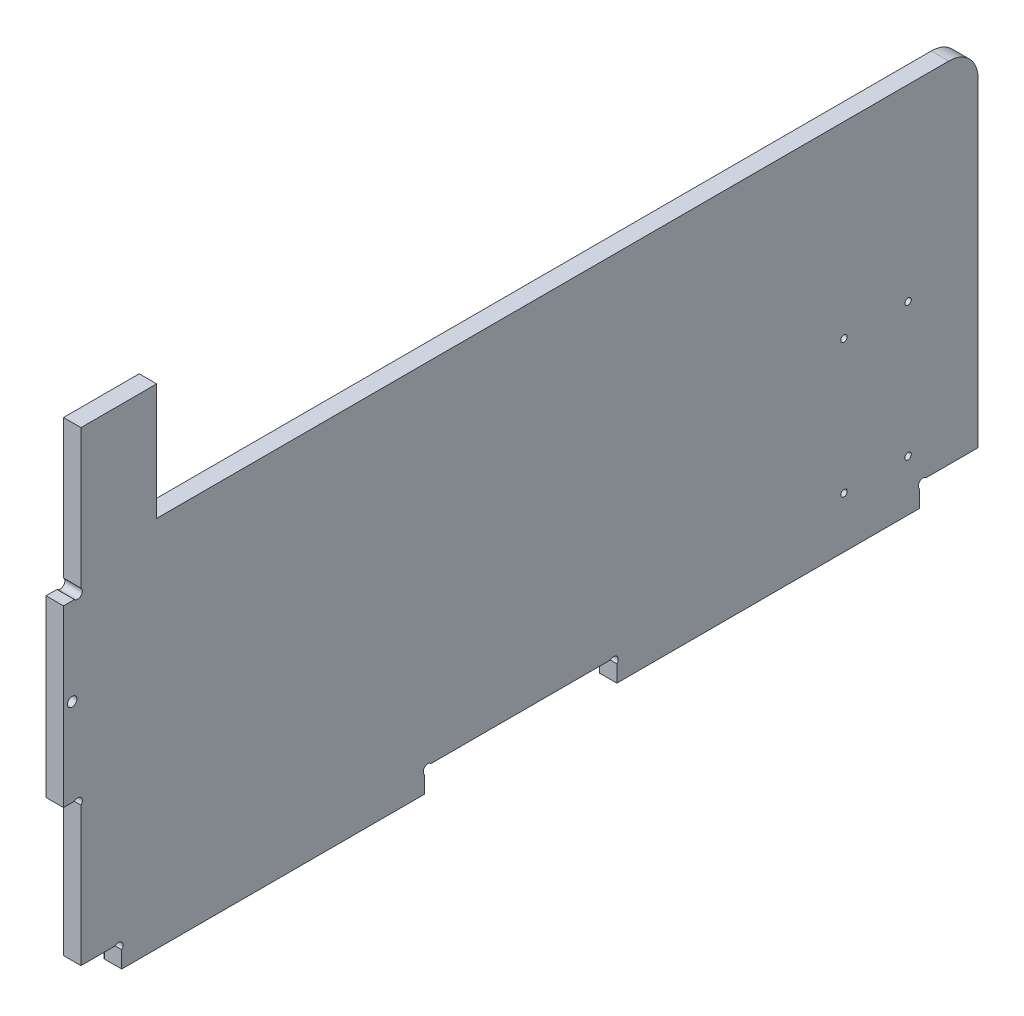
from build123d import *

# Parameters (mm, degrees)
ESQUISSE1_R        = 1.6
ESQUISSE1_R_2      = 1.1
BOSS_EXTRU_1_DEPTH = 6


with BuildPart() as part:
    # Esquisse1 → Boss.-Extru.1 (new body)
    with BuildSketch(Plane(origin=(0, 0, 0), x_dir=(0, 0, -1), z_dir=(1, 0, 0))):
        with BuildLine():
            Line((294, 5.7372583), (294, 0))
            Line((294, 0), (190, 0))
            Line((190, 0), (190, 5.7372583))
            ThreePointArc((190, 5.7372583), (190, 8), (187.7372583, 8))
            Line((187.7372583, 8), (126.2627417, 8))
            ThreePointArc((126.2627417, 8), (124, 8), (124, 5.7372583))
            Line((124, 5.7372583), (124, 0))
            Line((124, 0), (20, 0))
            Line((20, 0), (20, 5.7372583))
            ThreePointArc((20, 5.7372583), (20, 8), (17.7372583, 8))
            Line((17.7372583, 8), (6, 8))
            Line((6, 8), (6, 55.7372583))
            ThreePointArc((6, 55.7372583), (6, 58), (3.7372583, 58))
            Line((3.7372583, 58), (0, 58))
            Line((0, 58), (0, 118))
            Line((0, 118), (3.7372583, 118))
            ThreePointArc((3.7372583, 118), (6, 118), (6, 120.2627417))
            Line((6, 120.2627417), (6, 168))
            Line((6, 168), (32, 168))
            Line((32, 168), (32, 128))
            Line((32, 128), (304, 128))
            ThreePointArc((304, 128), (311.071067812, 125.071067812), (314, 118))
            Line((314, 118), (314, 8))
            Line((314, 8), (296.2627417, 8))
            ThreePointArc((296.2627417, 8), (294, 8), (294, 5.7372583))
        make_face()
        with Locations((3, 88)):
            Circle(ESQUISSE1_R, mode=Mode.SUBTRACT)
        with Locations((268, 17.5)):
            Circle(ESQUISSE1_R_2, mode=Mode.SUBTRACT)
        with Locations((290, 17.5)):
            Circle(ESQUISSE1_R_2, mode=Mode.SUBTRACT)
        with Locations((268, 63.5)):
            Circle(ESQUISSE1_R_2, mode=Mode.SUBTRACT)
        with Locations((290, 63.5)):
            Circle(ESQUISSE1_R_2, mode=Mode.SUBTRACT)
    extrude(amount=BOSS_EXTRU_1_DEPTH)


solid = part.part
